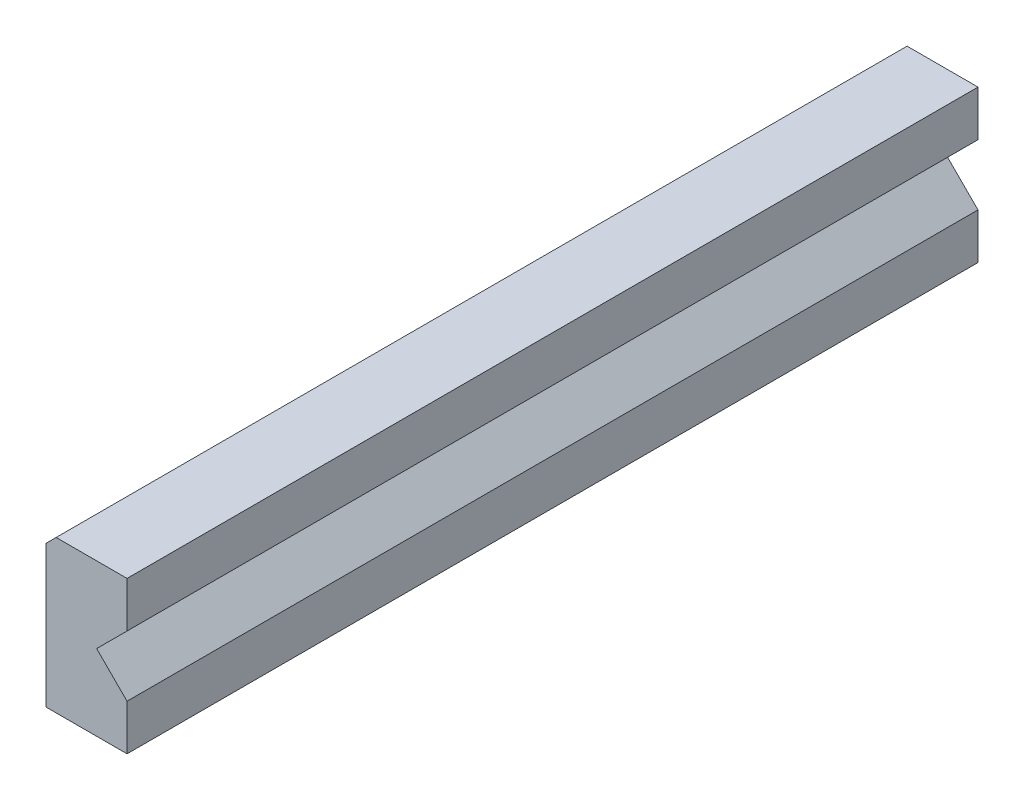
ISO-10303-21;
HEADER;
FILE_DESCRIPTION(('STEP AP214'),'2;1');
FILE_NAME('part.step','',(''),(''),'','','');
FILE_SCHEMA(('AUTOMOTIVE_DESIGN { 1 0 10303 214 1 1 1 1 }'));
ENDSEC;
DATA;
#1=APPLICATION_CONTEXT('core data for automotive mechanical design processes');
#2=APPLICATION_PROTOCOL_DEFINITION('international standard','automotive_design',2000,#1);
#3=PRODUCT_CONTEXT('',#1,'mechanical');
#4=PRODUCT('Part','Part','',(#3));
#5=PRODUCT_RELATED_PRODUCT_CATEGORY('part','',(#4));
#6=PRODUCT_DEFINITION_FORMATION('','',#4);
#7=PRODUCT_DEFINITION_CONTEXT('part definition',#1,'design');
#8=PRODUCT_DEFINITION('design','',#6,#7);
#9=PRODUCT_DEFINITION_SHAPE('','',#8);
#10=(LENGTH_UNIT() NAMED_UNIT(*) SI_UNIT(.MILLI.,.METRE.));
#11=(NAMED_UNIT(*) PLANE_ANGLE_UNIT() SI_UNIT($,.RADIAN.));
#12=(NAMED_UNIT(*) SI_UNIT($,.STERADIAN.) SOLID_ANGLE_UNIT());
#13=UNCERTAINTY_MEASURE_WITH_UNIT(LENGTH_MEASURE(1.E-05),#10,'distance_accuracy_value','');
#14=(GEOMETRIC_REPRESENTATION_CONTEXT(3) GLOBAL_UNCERTAINTY_ASSIGNED_CONTEXT((#13)) GLOBAL_UNIT_ASSIGNED_CONTEXT((#10,
#11,#12)) REPRESENTATION_CONTEXT('',''));
#15=CARTESIAN_POINT('',(0.,0.,0.));
#16=DIRECTION('',(0.,0.,1.));
#17=DIRECTION('',(1.,0.,0.));
#18=AXIS2_PLACEMENT_3D('',#15,#16,#17);
#19=CARTESIAN_POINT('',(4.,0.,-42.));
#20=DIRECTION('',(1.,0.,0.));
#21=DIRECTION('',(0.,0.,-1.));
#22=AXIS2_PLACEMENT_3D('',#19,#20,#21);
#23=PLANE('',#22);
#24=DIRECTION('',(0.,0.,-1.));
#25=VECTOR('',#24,1.);
#26=CARTESIAN_POINT('',(4.,2.24999999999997,-42.));
#27=LINE('',#26,#25);
#28=CARTESIAN_POINT('',(4.,2.24999999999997,0.));
#29=VERTEX_POINT('',#28);
#30=CARTESIAN_POINT('',(4.,2.24999999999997,-42.));
#31=VERTEX_POINT('',#30);
#32=EDGE_CURVE('E122',#29,#31,#27,.T.);
#33=ORIENTED_EDGE('',*,*,#32,.F.);
#34=DIRECTION('',(0.,1.,0.));
#35=VECTOR('',#34,1.);
#36=CARTESIAN_POINT('',(4.,0.,0.));
#37=LINE('',#36,#35);
#38=CARTESIAN_POINT('',(4.,0.,0.));
#39=VERTEX_POINT('',#38);
#40=EDGE_CURVE('E116',#39,#29,#37,.T.);
#41=ORIENTED_EDGE('',*,*,#40,.F.);
#42=DIRECTION('',(0.,0.,1.));
#43=VECTOR('',#42,1.);
#44=CARTESIAN_POINT('',(4.,0.,-42.));
#45=LINE('',#44,#43);
#46=CARTESIAN_POINT('',(4.,0.,-42.));
#47=VERTEX_POINT('',#46);
#48=EDGE_CURVE('E147',#47,#39,#45,.T.);
#49=ORIENTED_EDGE('',*,*,#48,.F.);
#50=DIRECTION('',(0.,1.,0.));
#51=VECTOR('',#50,1.);
#52=CARTESIAN_POINT('',(4.,0.,-42.));
#53=LINE('',#52,#51);
#54=EDGE_CURVE('E138',#47,#31,#53,.T.);
#55=ORIENTED_EDGE('',*,*,#54,.T.);
#56=EDGE_LOOP('',(#33,#41,#49,#55));
#57=FACE_BOUND('',#56,.T.);
#58=ADVANCED_FACE('F29',(#57),#23,.T.);
#59=CARTESIAN_POINT('',(0.,0.,-42.));
#60=DIRECTION('',(-1.,0.,0.));
#61=DIRECTION('',(0.,0.,1.));
#62=AXIS2_PLACEMENT_3D('',#59,#60,#61);
#63=PLANE('',#62);
#64=DIRECTION('',(0.,-1.,0.));
#65=VECTOR('',#64,1.);
#66=CARTESIAN_POINT('',(0.,0.,0.));
#67=LINE('',#66,#65);
#68=CARTESIAN_POINT('',(0.,7.,0.));
#69=VERTEX_POINT('',#68);
#70=CARTESIAN_POINT('',(0.,0.,0.));
#71=VERTEX_POINT('',#70);
#72=EDGE_CURVE('E124',#69,#71,#67,.T.);
#73=ORIENTED_EDGE('',*,*,#72,.F.);
#74=DIRECTION('',(0.,0.,-1.));
#75=VECTOR('',#74,1.);
#76=CARTESIAN_POINT('',(0.,7.,-42.));
#77=LINE('',#76,#75);
#78=CARTESIAN_POINT('',(0.,7.,-42.));
#79=VERTEX_POINT('',#78);
#80=EDGE_CURVE('E37',#69,#79,#77,.T.);
#81=ORIENTED_EDGE('',*,*,#80,.T.);
#82=DIRECTION('',(0.,-1.,0.));
#83=VECTOR('',#82,1.);
#84=CARTESIAN_POINT('',(0.,0.,-42.));
#85=LINE('',#84,#83);
#86=CARTESIAN_POINT('',(0.,0.,-42.));
#87=VERTEX_POINT('',#86);
#88=EDGE_CURVE('E132',#79,#87,#85,.T.);
#89=ORIENTED_EDGE('',*,*,#88,.T.);
#90=DIRECTION('',(0.,0.,1.));
#91=VECTOR('',#90,1.);
#92=CARTESIAN_POINT('',(0.,0.,-42.));
#93=LINE('',#92,#91);
#94=EDGE_CURVE('E144',#87,#71,#93,.T.);
#95=ORIENTED_EDGE('',*,*,#94,.T.);
#96=EDGE_LOOP('',(#73,#81,#89,#95));
#97=FACE_BOUND('',#96,.T.);
#98=ADVANCED_FACE('F31',(#97),#63,.T.);
#99=CARTESIAN_POINT('',(0.,7.5,-42.));
#100=DIRECTION('',(0.,1.,0.));
#101=DIRECTION('',(0.,0.,1.));
#102=AXIS2_PLACEMENT_3D('',#99,#100,#101);
#103=PLANE('',#102);
#104=DIRECTION('',(-1.,0.,0.));
#105=VECTOR('',#104,1.);
#106=CARTESIAN_POINT('',(0.,7.5,-42.));
#107=LINE('',#106,#105);
#108=CARTESIAN_POINT('',(4.,7.5,-42.));
#109=VERTEX_POINT('',#108);
#110=CARTESIAN_POINT('',(0.5,7.5,-42.));
#111=VERTEX_POINT('',#110);
#112=EDGE_CURVE('E141',#109,#111,#107,.T.);
#113=ORIENTED_EDGE('',*,*,#112,.T.);
#114=DIRECTION('',(0.,0.,1.));
#115=VECTOR('',#114,1.);
#116=CARTESIAN_POINT('',(0.5,7.5,-42.));
#117=LINE('',#116,#115);
#118=CARTESIAN_POINT('',(0.500000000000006,7.5,0.));
#119=VERTEX_POINT('',#118);
#120=EDGE_CURVE('E100',#111,#119,#117,.T.);
#121=ORIENTED_EDGE('',*,*,#120,.T.);
#122=DIRECTION('',(-1.,0.,0.));
#123=VECTOR('',#122,1.);
#124=CARTESIAN_POINT('',(0.,7.5,0.));
#125=LINE('',#124,#123);
#126=CARTESIAN_POINT('',(4.,7.5,0.));
#127=VERTEX_POINT('',#126);
#128=EDGE_CURVE('E130',#127,#119,#125,.T.);
#129=ORIENTED_EDGE('',*,*,#128,.F.);
#130=DIRECTION('',(0.,0.,1.));
#131=VECTOR('',#130,1.);
#132=CARTESIAN_POINT('',(4.,7.5,-42.));
#133=LINE('',#132,#131);
#134=EDGE_CURVE('E101',#109,#127,#133,.T.);
#135=ORIENTED_EDGE('',*,*,#134,.F.);
#136=EDGE_LOOP('',(#113,#121,#129,#135));
#137=FACE_BOUND('',#136,.T.);
#138=ADVANCED_FACE('F156',(#137),#103,.T.);
#139=DIRECTION('',(0.,0.,1.));
#140=VECTOR('',#139,1.);
#141=CARTESIAN_POINT('',(4.,5.25000000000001,-42.));
#142=LINE('',#141,#140);
#143=CARTESIAN_POINT('',(4.,5.25000000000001,-42.));
#144=VERTEX_POINT('',#143);
#145=CARTESIAN_POINT('',(4.,5.25000000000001,0.));
#146=VERTEX_POINT('',#145);
#147=EDGE_CURVE('E97',#144,#146,#142,.T.);
#148=ORIENTED_EDGE('',*,*,#147,.F.);
#149=EDGE_CURVE('E137',#144,#109,#53,.T.);
#150=ORIENTED_EDGE('',*,*,#149,.T.);
#151=ORIENTED_EDGE('',*,*,#134,.T.);
#152=EDGE_CURVE('E128',#146,#127,#37,.T.);
#153=ORIENTED_EDGE('',*,*,#152,.F.);
#154=EDGE_LOOP('',(#148,#150,#151,#153));
#155=FACE_BOUND('',#154,.T.);
#156=ADVANCED_FACE('F162',(#155),#23,.T.);
#157=CARTESIAN_POINT('',(0.,0.,-42.));
#158=DIRECTION('',(0.,-1.,0.));
#159=DIRECTION('',(0.,0.,-1.));
#160=AXIS2_PLACEMENT_3D('',#157,#158,#159);
#161=PLANE('',#160);
#162=DIRECTION('',(1.,0.,0.));
#163=VECTOR('',#162,1.);
#164=CARTESIAN_POINT('',(0.,0.,0.));
#165=LINE('',#164,#163);
#166=EDGE_CURVE('E126',#71,#39,#165,.T.);
#167=ORIENTED_EDGE('',*,*,#166,.F.);
#168=ORIENTED_EDGE('',*,*,#94,.F.);
#169=DIRECTION('',(1.,0.,0.));
#170=VECTOR('',#169,1.);
#171=CARTESIAN_POINT('',(0.,0.,-42.));
#172=LINE('',#171,#170);
#173=EDGE_CURVE('E134',#87,#47,#172,.T.);
#174=ORIENTED_EDGE('',*,*,#173,.T.);
#175=ORIENTED_EDGE('',*,*,#48,.T.);
#176=EDGE_LOOP('',(#167,#168,#174,#175));
#177=FACE_BOUND('',#176,.T.);
#178=ADVANCED_FACE('F182',(#177),#161,.T.);
#179=CARTESIAN_POINT('',(0.,7.5,-42.));
#180=DIRECTION('',(0.,0.,-1.));
#181=DIRECTION('',(-1.,0.,0.));
#182=AXIS2_PLACEMENT_3D('',#179,#180,#181);
#183=PLANE('',#182);
#184=ORIENTED_EDGE('',*,*,#88,.F.);
#185=DIRECTION('',(-0.707106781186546,-0.707106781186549,0.));
#186=VECTOR('',#185,1.);
#187=CARTESIAN_POINT('',(0.250000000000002,7.25,-42.));
#188=LINE('',#187,#186);
#189=EDGE_CURVE('E11',#79,#111,#188,.F.);
#190=ORIENTED_EDGE('',*,*,#189,.T.);
#191=ORIENTED_EDGE('',*,*,#112,.F.);
#192=ORIENTED_EDGE('',*,*,#149,.F.);
#193=DIRECTION('',(-0.707106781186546,-0.707106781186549,0.));
#194=VECTOR('',#193,1.);
#195=CARTESIAN_POINT('',(2.50000000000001,3.75,-42.));
#196=LINE('',#195,#194);
#197=CARTESIAN_POINT('',(2.50000000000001,3.75,-42.));
#198=VERTEX_POINT('',#197);
#199=EDGE_CURVE('E110',#144,#198,#196,.T.);
#200=ORIENTED_EDGE('',*,*,#199,.T.);
#201=DIRECTION('',(0.70710678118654,-0.707106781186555,0.));
#202=VECTOR('',#201,1.);
#203=CARTESIAN_POINT('',(2.50000000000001,3.75,-42.));
#204=LINE('',#203,#202);
#205=EDGE_CURVE('E108',#198,#31,#204,.T.);
#206=ORIENTED_EDGE('',*,*,#205,.T.);
#207=ORIENTED_EDGE('',*,*,#54,.F.);
#208=ORIENTED_EDGE('',*,*,#173,.F.);
#209=EDGE_LOOP('',(#184,#190,#191,#192,#200,#206,#207,#208));
#210=FACE_BOUND('',#209,.T.);
#211=ADVANCED_FACE('F165',(#210),#183,.T.);
#212=CARTESIAN_POINT('',(0.,7.5,0.));
#213=DIRECTION('',(0.,0.,-1.));
#214=DIRECTION('',(-1.,0.,0.));
#215=AXIS2_PLACEMENT_3D('',#212,#213,#214);
#216=PLANE('',#215);
#217=ORIENTED_EDGE('',*,*,#128,.T.);
#218=DIRECTION('',(0.707106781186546,0.707106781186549,0.));
#219=VECTOR('',#218,1.);
#220=CARTESIAN_POINT('',(0.500000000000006,7.5,0.));
#221=LINE('',#220,#219);
#222=EDGE_CURVE('E51',#119,#69,#221,.F.);
#223=ORIENTED_EDGE('',*,*,#222,.T.);
#224=ORIENTED_EDGE('',*,*,#72,.T.);
#225=ORIENTED_EDGE('',*,*,#166,.T.);
#226=ORIENTED_EDGE('',*,*,#40,.T.);
#227=DIRECTION('',(0.70710678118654,-0.707106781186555,0.));
#228=VECTOR('',#227,1.);
#229=CARTESIAN_POINT('',(2.5,3.75,0.));
#230=LINE('',#229,#228);
#231=CARTESIAN_POINT('',(2.5,3.75,0.));
#232=VERTEX_POINT('',#231);
#233=EDGE_CURVE('E105',#232,#29,#230,.T.);
#234=ORIENTED_EDGE('',*,*,#233,.F.);
#235=DIRECTION('',(0.707106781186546,0.707106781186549,0.));
#236=VECTOR('',#235,1.);
#237=CARTESIAN_POINT('',(3.125,4.37500000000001,0.));
#238=LINE('',#237,#236);
#239=EDGE_CURVE('E91',#232,#146,#238,.T.);
#240=ORIENTED_EDGE('',*,*,#239,.T.);
#241=ORIENTED_EDGE('',*,*,#152,.T.);
#242=EDGE_LOOP('',(#217,#223,#224,#225,#226,#234,#240,#241));
#243=FACE_BOUND('',#242,.T.);
#244=ADVANCED_FACE('F113',(#243),#216,.F.);
#245=CARTESIAN_POINT('',(2.50000000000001,3.75,-42.));
#246=DIRECTION('',(-0.707106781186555,-0.70710678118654,0.));
#247=DIRECTION('',(0.70710678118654,-0.707106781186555,0.));
#248=AXIS2_PLACEMENT_3D('',#245,#246,#247);
#249=PLANE('',#248);
#250=ORIENTED_EDGE('',*,*,#32,.T.);
#251=ORIENTED_EDGE('',*,*,#205,.F.);
#252=DIRECTION('',(0.,0.,1.));
#253=VECTOR('',#252,1.);
#254=CARTESIAN_POINT('',(2.50000000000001,3.75,-42.));
#255=LINE('',#254,#253);
#256=EDGE_CURVE('E94',#198,#232,#255,.T.);
#257=ORIENTED_EDGE('',*,*,#256,.T.);
#258=ORIENTED_EDGE('',*,*,#233,.T.);
#259=EDGE_LOOP('',(#250,#251,#257,#258));
#260=FACE_BOUND('',#259,.T.);
#261=ADVANCED_FACE('F104',(#260),#249,.F.);
#262=CARTESIAN_POINT('',(2.50000000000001,3.75,-42.));
#263=DIRECTION('',(-0.707106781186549,0.707106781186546,0.));
#264=DIRECTION('',(-0.707106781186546,-0.707106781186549,0.));
#265=AXIS2_PLACEMENT_3D('',#262,#263,#264);
#266=PLANE('',#265);
#267=ORIENTED_EDGE('',*,*,#147,.T.);
#268=ORIENTED_EDGE('',*,*,#239,.F.);
#269=ORIENTED_EDGE('',*,*,#256,.F.);
#270=ORIENTED_EDGE('',*,*,#199,.F.);
#271=EDGE_LOOP('',(#267,#268,#269,#270));
#272=FACE_BOUND('',#271,.T.);
#273=ADVANCED_FACE('F93',(#272),#266,.F.);
#274=CARTESIAN_POINT('',(0.5,7.5,-42.));
#275=DIRECTION('',(0.707106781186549,-0.707106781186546,0.));
#276=DIRECTION('',(0.707106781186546,0.707106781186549,0.));
#277=AXIS2_PLACEMENT_3D('',#274,#275,#276);
#278=PLANE('',#277);
#279=ORIENTED_EDGE('',*,*,#189,.F.);
#280=ORIENTED_EDGE('',*,*,#80,.F.);
#281=ORIENTED_EDGE('',*,*,#222,.F.);
#282=ORIENTED_EDGE('',*,*,#120,.F.);
#283=EDGE_LOOP('',(#279,#280,#281,#282));
#284=FACE_BOUND('',#283,.T.);
#285=ADVANCED_FACE('F167',(#284),#278,.F.);
#286=CLOSED_SHELL('',(#58,#98,#138,#156,#178,#211,#244,#261,#273,#285));
#287=MANIFOLD_SOLID_BREP('B2',#286);
#288=ADVANCED_BREP_SHAPE_REPRESENTATION('',(#18,#287),#14);
#289=SHAPE_DEFINITION_REPRESENTATION(#9,#288);
ENDSEC;
END-ISO-10303-21;
